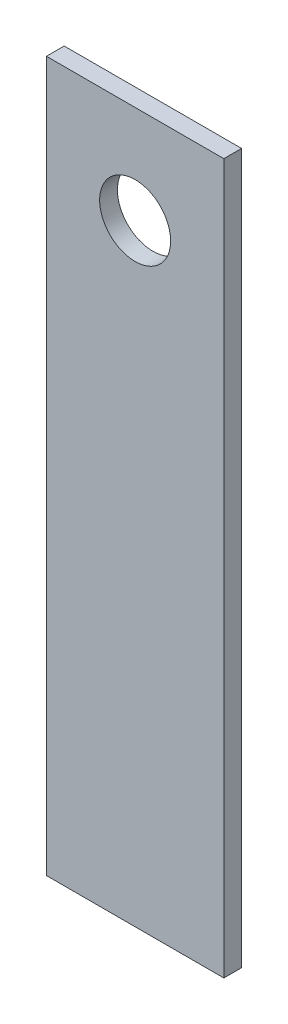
from build123d import *

# Parameters (mm, degrees)
SKIZZE1_W               = 100
SKIZZE1_H               = 400
SKIZZE1_R               = 20
LINEAR_AUSTRAGEN1_DEPTH = 10


with BuildPart() as part:
    # Skizze1 → Linear austragen1 (new body)
    with BuildSketch(Plane.XY):
        Rectangle(SKIZZE1_W, SKIZZE1_H)
        with Locations((0, 144.784928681)):
            Circle(SKIZZE1_R, mode=Mode.SUBTRACT)
    extrude(amount=LINEAR_AUSTRAGEN1_DEPTH)


solid = part.part
